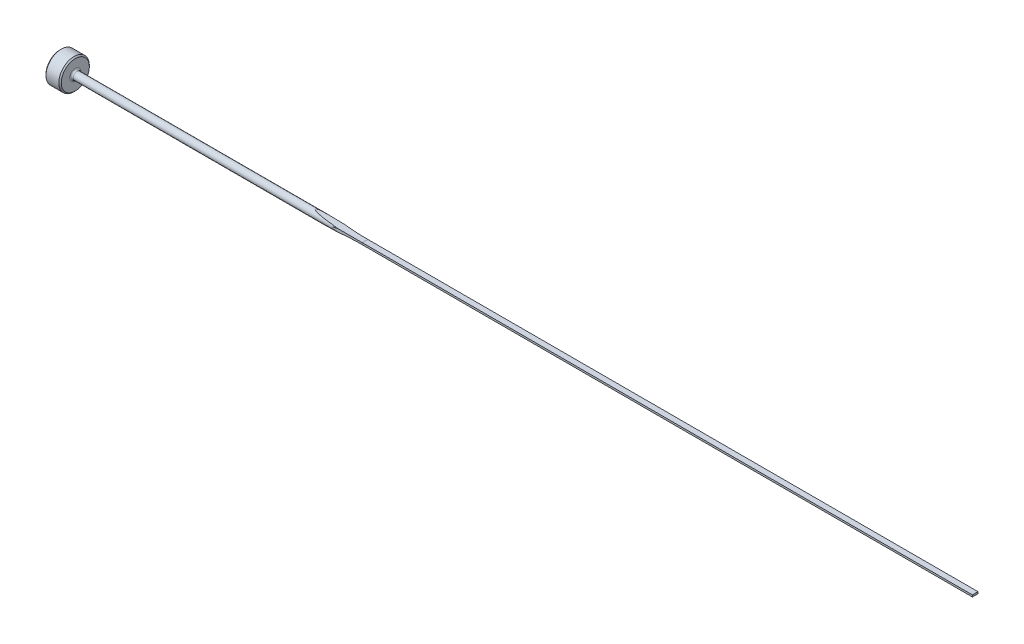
from build123d import *

# Parameters (mm, degrees)
CUT_EXTRUDE1_DEPTH = 191.552909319
CUT_EXTRUDE2_DEPTH = 191.552909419
FILLET1_R          = 0.381
CHAMFER1_SIZE      = 0.254


with BuildPart() as part:
    # Sketch1 → Revolve1 (revolve)
    with BuildSketch(Plane.XY, mode=Mode.PRIVATE) as revolve1_sk:
        Polygon((0, 0), (0, 3.175), (3.175, 3.175), (3.175, 0.79375), (190.5, 0.79375), (190.5, 0), align=None)
    revolve(revolve1_sk.sketch.rotate(Axis((0, 0, 0), (1, 0, 0)), 90), axis=Axis((0, 0, 0), (1, 0, 0)))

    # Sketch2 → Cut-Extrude1 (cut, symmetric)
    with BuildSketch(Plane.XY):
        with BuildLine():
            Line((190.5, 0.79375), (190.5, 0.1905))
            Line((190.5, 0.1905), (63.5, 0.1905))
            ThreePointArc((63.5, 0.1905), (58.321731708, 0.341440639), (53.161047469, 0.79375))
            Line((53.161047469, 0.79375), (190.5, 0.79375))
        make_face()
    cut_extrude1 = extrude(amount=CUT_EXTRUDE1_DEPTH, both=True, mode=Mode.SUBTRACT)

    # Mirror1: Cut-Extrude1 across plane
    add(cut_extrude1.mirror(Plane.ZX), mode=Mode.SUBTRACT)

    # Sketch3 → Cut-Extrude2 (cut, symmetric)
    with BuildSketch(Plane(origin=(0, 0, 0), x_dir=(1, 0, 0), z_dir=(0, 1, 0))):
        with BuildLine():
            Line((190.5, 0.79375), (190.5, 0.5842))
            Line((190.5, 0.5842), (63.5, 0.5842))
            ThreePointArc((63.5, 0.5842), (60.44803383, 0.636602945), (57.399665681, 0.79375))
            Line((57.399665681, 0.79375), (190.5, 0.79375))
        make_face()
    cut_extrude2 = extrude(amount=CUT_EXTRUDE2_DEPTH, both=True, mode=Mode.SUBTRACT)

    # Mirror2: Cut-Extrude2 across plane
    add(cut_extrude2.mirror(Plane.XY), mode=Mode.SUBTRACT)

    # Fillet1
    fillet1_edges = [part.edges().sort_by_distance(p)[0] for p in [
        (3.175, 0, -0.79375),
    ]]
    fillet(fillet1_edges, radius=FILLET1_R)

    # Chamfer1
    chamfer1_edges = [part.edges().sort_by_distance(p)[0] for p in [
        (3.175, 0, -3.175),
        (0, 0, -3.175),
    ]]
    chamfer(chamfer1_edges, length=CHAMFER1_SIZE)


solid = part.part
